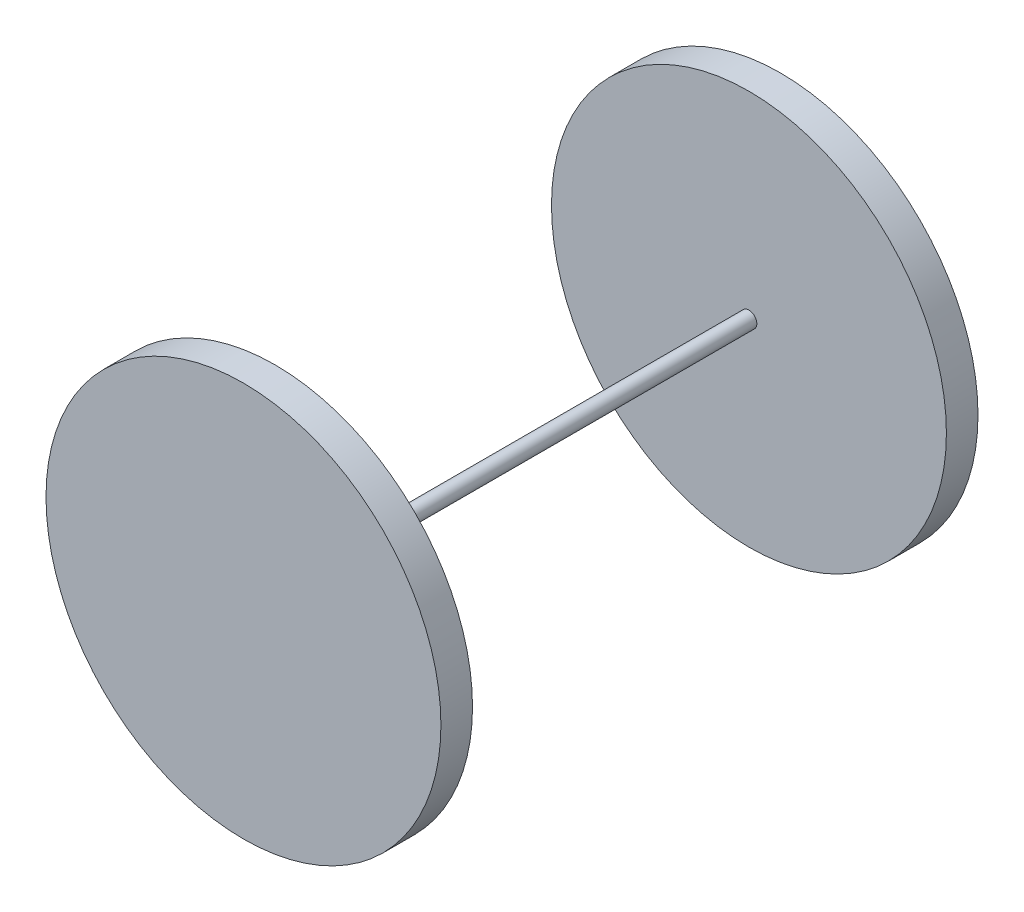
from build123d import *

# Parameters (mm, degrees)
ESQUISSE1_R      = 125
EXTRUSION1_DEPTH = 20
ESQUISSE2_R      = 5
EXTRUSION2_DEPTH = 300
ESQUISSE3_R      = 125
EXTRUSION3_DEPTH = 20


with BuildPart() as part:
    # Esquisse1 → Extrusion1 (new body)
    with BuildSketch(Plane.XY):
        Circle(ESQUISSE1_R)
    extrude(amount=EXTRUSION1_DEPTH)

    # Esquisse2 → Extrusion2 (add)
    with BuildSketch(Plane.XY.offset(20)):
        Circle(ESQUISSE2_R)
    extrude(amount=EXTRUSION2_DEPTH)

    # Esquisse3 → Extrusion3 (add)
    with BuildSketch(Plane.XY.offset(320)):
        Circle(ESQUISSE3_R)
    extrude(amount=EXTRUSION3_DEPTH)


solid = part.part
